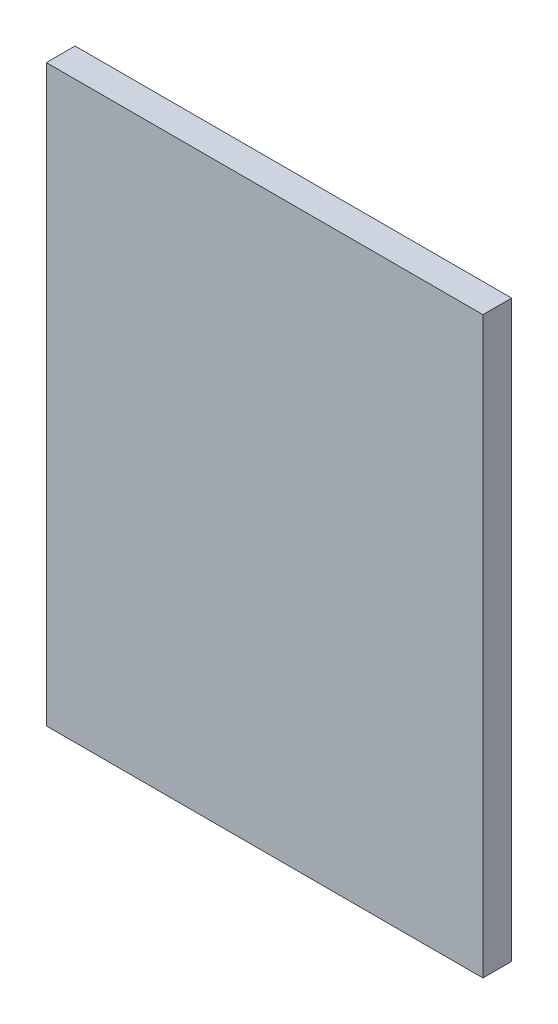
from build123d import *

# Parameters (mm, degrees)
SKETCH1_W           = 96.52
SKETCH1_H           = 127
BOSS_EXTRUDE1_DEPTH = 6.35
SKETCH2_W           = 83.82
SKETCH2_H           = 114.3
SKETCH2_W_2         = 78.74
SKETCH2_H_2         = 109.22
BOSS_EXTRUDE2_DEPTH = 6.35


with BuildPart() as part:
    # Sketch1 → Boss-Extrude1 (new body)
    with BuildSketch(Plane.XY):
        Rectangle(SKETCH1_W, SKETCH1_H)
    extrude(amount=BOSS_EXTRUDE1_DEPTH)

    # Sketch2 → Boss-Extrude2 (add)
    with BuildSketch(Plane(origin=(0, 0, 0), x_dir=(-1, 0, 0), z_dir=(0, 0, -1))):
        Rectangle(SKETCH2_W, SKETCH2_H)
        Rectangle(SKETCH2_W_2, SKETCH2_H_2, mode=Mode.SUBTRACT)
    extrude(amount=BOSS_EXTRUDE2_DEPTH)


solid = part.part
